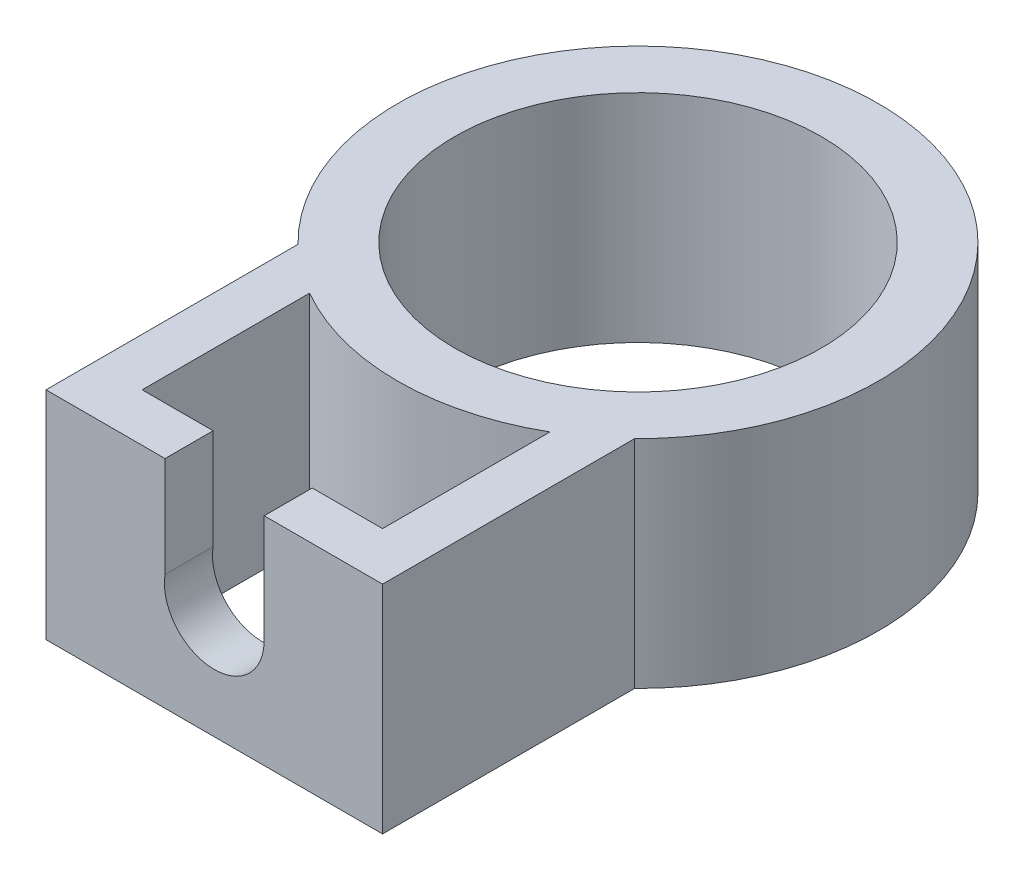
from build123d import *

# Parameters (mm, degrees)
CROQUIS1_R              = 15.25
SALIENTE_EXTRUIR1_DEPTH = 18
CROQUIS2_R              = 4.15
CORTAR_EXTRUIR1_DEPTH   = 10
CROQUIS3_W              = 8.247844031
CROQUIS3_H              = 9.546625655
CORTAR_EXTRUIR2_DEPTH   = 4


with BuildPart() as part:
    # Croquis1 → Saliente-Extruir1 (new body)
    with BuildSketch(Plane(origin=(0, 0, 0), x_dir=(1, 0, 0), z_dir=(0, 1, 0))):
        with BuildLine():
            Line((14, -35.25), (14, -14.282856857))
            ThreePointArc((14, -14.282856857), (0, 20), (-14, -14.282856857))
            Line((-14, -14.282856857), (-14, -35.25))
            Line((-14, -35.25), (-6.5, -35.25))
            Line((-6.5, -35.25), (6.5, -35.25))
            Line((6.5, -35.25), (14, -35.25))
        make_face()
        with Locations(Location((0, 0, 0), (0, 0, 270))):
            Circle(CROQUIS1_R, mode=Mode.SUBTRACT)
        with BuildLine():
            Line((-10, -31.25), (-6.5, -31.25))
            Line((-6.5, -31.25), (6.5, -31.25))
            Line((6.5, -31.25), (10, -31.25))
            Line((10, -31.25), (10, -17.320508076))
            ThreePointArc((10, -17.320508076), (0, -20), (-10, -17.320508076))
            Line((-10, -17.320508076), (-10, -31.25))
        make_face(mode=Mode.SUBTRACT)
    extrude(amount=SALIENTE_EXTRUIR1_DEPTH)

    # Croquis2 → Cortar-Extruir1 (cut)
    with BuildSketch(Plane.XY.offset(35.25)):
        with Locations((0, 9)):
            Circle(CROQUIS2_R)
    extrude(amount=-CORTAR_EXTRUIR1_DEPTH, mode=Mode.SUBTRACT)

    # Croquis3 → Cortar-Extruir2 (cut)
    with BuildSketch(Plane.XY.offset(35.25)):
        with Locations((0.026077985, 13.638219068)):
            Rectangle(CROQUIS3_W, CROQUIS3_H)
    extrude(amount=-CORTAR_EXTRUIR2_DEPTH, mode=Mode.SUBTRACT)


solid = part.part
